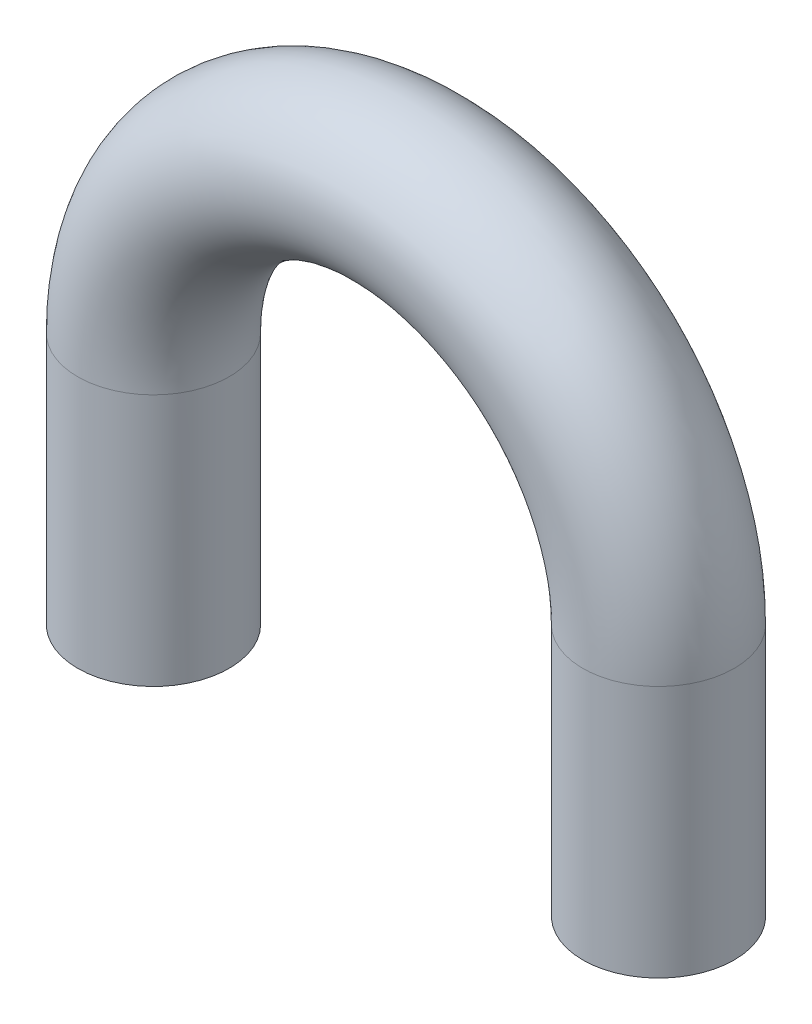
from build123d import *

# Parameters (mm, degrees)
ESQUISSE2_R = 1.5


with BuildPart() as part:
    # Balayage1: sweep along a path in Esquisse1
    with BuildLine(Plane.XY) as balayage1_path:
        Line((0, 0), (0, 5))
        ThreePointArc((0, 5), (5, 10), (10, 5))
        Line((10, 5), (10, 0))
    # Esquisse2 → Balayage1 (sweep)
    with BuildSketch(Plane(origin=(0, 0, 0), x_dir=(1, 0, 0), z_dir=(0, 1, 0))):
        Circle(ESQUISSE2_R)
    sweep(path=balayage1_path.line)


solid = part.part
